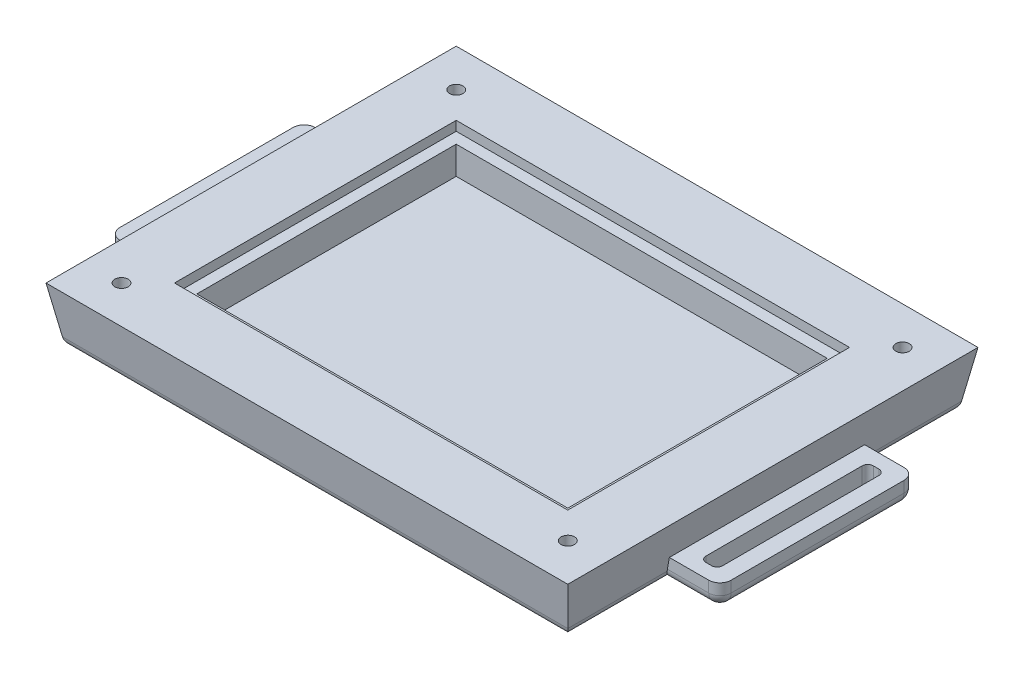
from build123d import *

# Parameters (mm, degrees)
SKETCH1_W                       = 90
SKETCH1_H                       = 70
BOSS_EXTRUDE1_DEPTH             = 10
BOSS_EXTRUDE1_DRAFT             = -10
SKETCH2_W                       = 70.5
SKETCH2_H                       = 50.5
CUT_EXTRUDE1_DEPTH              = 1.7
SKETCH3_W                       = 66.5
SKETCH3_H                       = 46.5
CUT_EXTRUDE2_DEPTH              = 5
M2_CLEARANCE_HOLE1_D            = 2.4
M2_CLEARANCE_HOLE1_DEPTH        = 5
M2_CLEARANCE_HOLE1_TIP          = 0.721032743
SKETCH7_W                       = 35
SKETCH7_H                       = 4
BOSS_EXTRUDE2_DEPTH             = 8
BOSS_EXTRUDE2_DIRECTION_2_REACH = 102.989
CUT_EXTRUDE3_DEPTH              = 67.231063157
FILLET1_R                       = 2
FILLET1_OF_MIRROR1_R            = 2
FILLET2_R                       = 2


with BuildPart() as part:
    # Sketch1 → Boss-Extrude1 (with draft: the straight prism first)
    with BuildSketch(Plane(origin=(0, 0, 0), x_dir=(1, 0, 0), z_dir=(0, 1, 0))):
        Rectangle(SKETCH1_W, SKETCH1_H)
    extrude(amount=BOSS_EXTRUDE1_DEPTH)
    # Boss-Extrude1: the draft: its side faces are tilted about the plane it starts from
    boss_extrude1_sides = [part.faces().sort_by_distance(p)[0] for p in [
        (-45, 5, 0),
        (0, 5, 35),
        (45, 5, 0),
        (0, 5, -35),
    ]]
    draft(boss_extrude1_sides, Plane(origin=(0, 0, 0), x_dir=(1, 0, 0), z_dir=(0, 1, 0)), BOSS_EXTRUDE1_DRAFT)

    # Sketch2 → Cut-Extrude1 (cut)
    with BuildSketch(Plane(origin=(0, 10, 0), x_dir=(1, 0, 0), z_dir=(0, 1, 0))):
        Rectangle(SKETCH2_W, SKETCH2_H)
    extrude(amount=-CUT_EXTRUDE1_DEPTH, mode=Mode.SUBTRACT)

    # Sketch3 → Cut-Extrude2 (cut)
    with BuildSketch(Plane(origin=(0, 8.3, 0), x_dir=(1, 0, 0), z_dir=(0, 1, 0))):
        Rectangle(SKETCH3_W, SKETCH3_H)
    extrude(amount=-CUT_EXTRUDE2_DEPTH, mode=Mode.SUBTRACT)

    # M2 Clearance Hole1
    with Locations(Plane(origin=(0, 10, 0), x_dir=(1, 0, 0), z_dir=(0, 1, 0))):
        with Locations((-40, 30), (-40, -30), (40, -30), (40, 30)):
            Hole(M2_CLEARANCE_HOLE1_D / 2, depth=M2_CLEARANCE_HOLE1_DEPTH)
            with Locations((0, 0, -(M2_CLEARANCE_HOLE1_DEPTH + M2_CLEARANCE_HOLE1_TIP / 2))):  # 118° drill point
                Cone(0, M2_CLEARANCE_HOLE1_D / 2, M2_CLEARANCE_HOLE1_TIP, mode=Mode.SUBTRACT)

    # Sketch7 → Boss-Extrude2 (add)
    with BuildSketch(Plane(origin=(46.763269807, 0, 0), x_dir=(0, 0, -1), z_dir=(1, 0, 0))):
        with Locations((0, 2)):
            Rectangle(SKETCH7_W, SKETCH7_H)
    boss_extrude2 = extrude(amount=BOSS_EXTRUDE2_DEPTH)

    # Sketch7 → Boss-Extrude2 direction 2 (add, up to next)
    with BuildSketch(Plane(origin=(46.763269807, 0, 0), x_dir=(0, 0, -1), z_dir=(1, 0, 0)), mode=Mode.PRIVATE) as boss_extrude2_direction_2_sk1:
        with Locations((0, 2)):
            Rectangle(SKETCH7_W, SKETCH7_H)
    boss_extrude2_direction_2_tool1 = extrude(boss_extrude2_direction_2_sk1.sketch, amount=-BOSS_EXTRUDE2_DIRECTION_2_REACH, mode=Mode.PRIVATE) - part.part
    boss_extrude2_direction_2 = boss_extrude2_direction_2_tool1.solids().sort_by_distance((46.76327, 2, 0))[0]
    add(boss_extrude2_direction_2)

    # Sketch8 → Cut-Extrude3 (cut, through all)
    with BuildSketch(Plane(origin=(0, 4, 0), x_dir=(1, 0, 0), z_dir=(0, 1, 0))):
        with BuildLine():
            Line((49.763269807, -15), (50.763269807, -15))
            ThreePointArc((50.763269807, -15), (51.470376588, -14.707106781), (51.763269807, -14))
            Line((51.763269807, -14), (51.763269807, 14))
            ThreePointArc((51.763269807, 14), (51.470376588, 14.707106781), (50.763269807, 15))
            Line((50.763269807, 15), (49.763269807, 15))
            ThreePointArc((49.763269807, 15), (49.056163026, 14.707106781), (48.763269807, 14))
            Line((48.763269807, 14), (48.763269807, -14))
            ThreePointArc((48.763269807, -14), (49.056163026, -14.707106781), (49.763269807, -15))
        make_face()
    cut_extrude3 = extrude(amount=-CUT_EXTRUDE3_DEPTH, mode=Mode.SUBTRACT)

    # Fillet1
    fillet1_edges = [part.edges().sort_by_distance(p)[0] for p in [
        (54.763269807, 2, -17.5),
        (54.763269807, 2, 17.5),
    ]]
    fillet(fillet1_edges, radius=FILLET1_R)

    # Mirror1: Boss-Extrude2, Boss-Extrude2 direction 2, Cut-Extrude3 across plane
    add(boss_extrude2.mirror(Plane(origin=(0, 0, 0), x_dir=(0, 0, 1), z_dir=(1, 0, 0))))
    add(boss_extrude2_direction_2.mirror(Plane(origin=(0, 0, 0), x_dir=(0, 0, 1), z_dir=(1, 0, 0))))
    add(cut_extrude3.mirror(Plane(origin=(0, 0, 0), x_dir=(0, 0, 1), z_dir=(1, 0, 0))), mode=Mode.SUBTRACT)

    # Fillet1 of Mirror1
    fillet1_of_mirror1_edges = [part.edges().sort_by_distance(p)[0] for p in [
        (-54.763269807, 2, -17.5),
        (-54.763269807, 2, 17.5),
    ]]
    fillet(fillet1_of_mirror1_edges, radius=FILLET1_OF_MIRROR1_R)

    # Fillet2
    fillet2_edges = [part.edges().sort_by_distance(p)[0] for p in [
        (54.177483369, 0, 16.914213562),
        (54.177483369, 0, -16.914213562),
        (-45, 0, 26.25),
        (-48.881634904, 0, 17.5),
        (-48.881634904, 0, -17.5),
        (-54.763269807, 0, 0),
        (-54.177483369, 0, 16.914213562),
        (-54.177483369, 0, -16.914213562),
        (0, 0, -35),
        (45, 0, 26.25),
        (0, 0, 35),
        (45, 0, -26.25),
        (48.881634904, 0, 17.5),
        (-45, 0, -26.25),
        (48.881634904, 0, -17.5),
        (54.763269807, 0, 0),
    ]]
    fillet(fillet2_edges, radius=FILLET2_R)


solid = part.part
